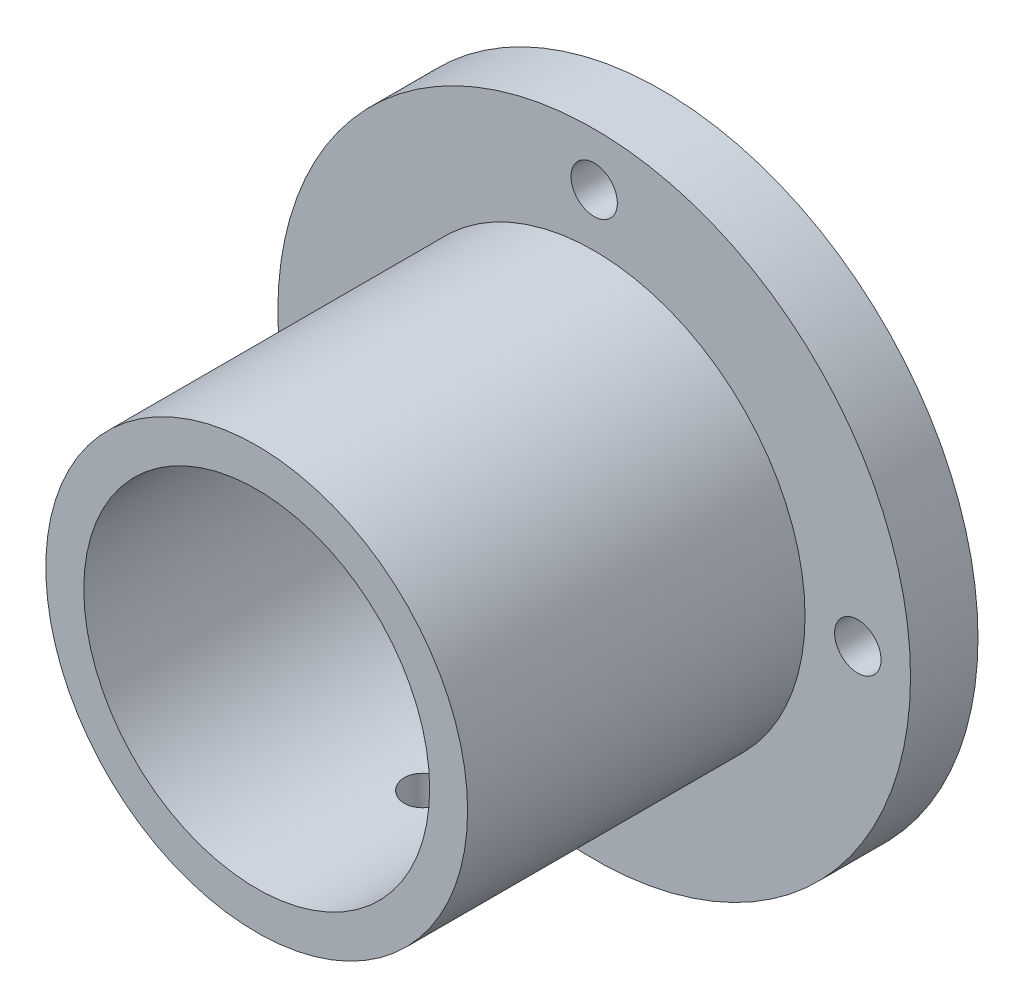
ISO-10303-21;
HEADER;
FILE_DESCRIPTION(('STEP AP214'),'2;1');
FILE_NAME('part.step','',(''),(''),'','','');
FILE_SCHEMA(('AUTOMOTIVE_DESIGN { 1 0 10303 214 1 1 1 1 }'));
ENDSEC;
DATA;
#1=APPLICATION_CONTEXT('core data for automotive mechanical design processes');
#2=APPLICATION_PROTOCOL_DEFINITION('international standard','automotive_design',2000,#1);
#3=PRODUCT_CONTEXT('',#1,'mechanical');
#4=PRODUCT('Part','Part','',(#3));
#5=PRODUCT_RELATED_PRODUCT_CATEGORY('part','',(#4));
#6=PRODUCT_DEFINITION_FORMATION('','',#4);
#7=PRODUCT_DEFINITION_CONTEXT('part definition',#1,'design');
#8=PRODUCT_DEFINITION('design','',#6,#7);
#9=PRODUCT_DEFINITION_SHAPE('','',#8);
#10=(LENGTH_UNIT() NAMED_UNIT(*) SI_UNIT(.MILLI.,.METRE.));
#11=(NAMED_UNIT(*) PLANE_ANGLE_UNIT() SI_UNIT($,.RADIAN.));
#12=(NAMED_UNIT(*) SI_UNIT($,.STERADIAN.) SOLID_ANGLE_UNIT());
#13=UNCERTAINTY_MEASURE_WITH_UNIT(LENGTH_MEASURE(1.E-05),#10,'distance_accuracy_value','');
#14=(GEOMETRIC_REPRESENTATION_CONTEXT(3) GLOBAL_UNCERTAINTY_ASSIGNED_CONTEXT((#13)) GLOBAL_UNIT_ASSIGNED_CONTEXT((#10,
#11,#12)) REPRESENTATION_CONTEXT('',''));
#15=CARTESIAN_POINT('',(0.,0.,0.));
#16=DIRECTION('',(0.,0.,1.));
#17=DIRECTION('',(1.,0.,0.));
#18=AXIS2_PLACEMENT_3D('',#15,#16,#17);
#19=CARTESIAN_POINT('',(0.,0.,8.));
#20=DIRECTION('',(0.,0.,1.));
#21=DIRECTION('',(1.,0.,0.));
#22=AXIS2_PLACEMENT_3D('',#19,#20,#21);
#23=PLANE('',#22);
#24=CARTESIAN_POINT('',(-31.25,0.,8.));
#25=DIRECTION('',(0.,0.,1.));
#26=DIRECTION('',(1.,0.,0.));
#27=AXIS2_PLACEMENT_3D('',#24,#25,#26);
#28=CIRCLE('',#27,2.75);
#29=CARTESIAN_POINT('',(-28.5,0.,8.));
#30=VERTEX_POINT('',#29);
#31=EDGE_CURVE('E64',#30,#30,#28,.T.);
#32=ORIENTED_EDGE('',*,*,#31,.F.);
#33=EDGE_LOOP('',(#32));
#34=FACE_BOUND('',#33,.T.);
#35=CARTESIAN_POINT('',(31.25,0.,8.));
#36=DIRECTION('',(0.,0.,1.));
#37=DIRECTION('',(1.,0.,0.));
#38=AXIS2_PLACEMENT_3D('',#35,#36,#37);
#39=CIRCLE('',#38,2.75);
#40=CARTESIAN_POINT('',(34.,0.,8.));
#41=VERTEX_POINT('',#40);
#42=EDGE_CURVE('E52',#41,#41,#39,.T.);
#43=ORIENTED_EDGE('',*,*,#42,.F.);
#44=EDGE_LOOP('',(#43));
#45=FACE_BOUND('',#44,.T.);
#46=CARTESIAN_POINT('',(0.,0.,8.));
#47=DIRECTION('',(0.,0.,1.));
#48=DIRECTION('',(1.,0.,0.));
#49=AXIS2_PLACEMENT_3D('',#46,#47,#48);
#50=CIRCLE('',#49,37.5);
#51=CARTESIAN_POINT('',(37.5,0.,8.));
#52=VERTEX_POINT('',#51);
#53=EDGE_CURVE('E10',#52,#52,#50,.T.);
#54=ORIENTED_EDGE('',*,*,#53,.T.);
#55=EDGE_LOOP('',(#54));
#56=FACE_BOUND('',#55,.T.);
#57=CARTESIAN_POINT('',(0.,-31.25,8.));
#58=DIRECTION('',(0.,0.,1.));
#59=DIRECTION('',(1.,0.,0.));
#60=AXIS2_PLACEMENT_3D('',#57,#58,#59);
#61=CIRCLE('',#60,2.75);
#62=CARTESIAN_POINT('',(2.75,-31.25,8.));
#63=VERTEX_POINT('',#62);
#64=EDGE_CURVE('E47',#63,#63,#61,.T.);
#65=ORIENTED_EDGE('',*,*,#64,.F.);
#66=EDGE_LOOP('',(#65));
#67=FACE_BOUND('',#66,.T.);
#68=CARTESIAN_POINT('',(0.,31.25,8.));
#69=DIRECTION('',(0.,0.,1.));
#70=DIRECTION('',(1.,0.,0.));
#71=AXIS2_PLACEMENT_3D('',#68,#69,#70);
#72=CIRCLE('',#71,2.75);
#73=CARTESIAN_POINT('',(2.75,31.25,8.));
#74=VERTEX_POINT('',#73);
#75=EDGE_CURVE('E58',#74,#74,#72,.T.);
#76=ORIENTED_EDGE('',*,*,#75,.F.);
#77=EDGE_LOOP('',(#76));
#78=FACE_BOUND('',#77,.T.);
#79=CARTESIAN_POINT('',(0.,0.,8.));
#80=DIRECTION('',(0.,0.,1.));
#81=DIRECTION('',(1.,0.,0.));
#82=AXIS2_PLACEMENT_3D('',#79,#80,#81);
#83=CIRCLE('',#82,25.);
#84=CARTESIAN_POINT('',(25.,0.,8.));
#85=VERTEX_POINT('',#84);
#86=EDGE_CURVE('E73',#85,#85,#83,.T.);
#87=ORIENTED_EDGE('',*,*,#86,.F.);
#88=EDGE_LOOP('',(#87));
#89=FACE_BOUND('',#88,.T.);
#90=ADVANCED_FACE('F30',(#34,#45,#56,#67,#78,#89),#23,.T.);
#91=CARTESIAN_POINT('',(0.,0.,0.));
#92=DIRECTION('',(0.,0.,1.));
#93=DIRECTION('',(1.,0.,0.));
#94=AXIS2_PLACEMENT_3D('',#91,#92,#93);
#95=PLANE('',#94);
#96=CARTESIAN_POINT('',(0.,0.,0.));
#97=DIRECTION('',(0.,0.,1.));
#98=DIRECTION('',(1.,0.,0.));
#99=AXIS2_PLACEMENT_3D('',#96,#97,#98);
#100=CIRCLE('',#99,20.5);
#101=CARTESIAN_POINT('',(20.5,0.,0.));
#102=VERTEX_POINT('',#101);
#103=EDGE_CURVE('E76',#102,#102,#100,.T.);
#104=ORIENTED_EDGE('',*,*,#103,.T.);
#105=EDGE_LOOP('',(#104));
#106=FACE_BOUND('',#105,.T.);
#107=CARTESIAN_POINT('',(0.,31.25,0.));
#108=DIRECTION('',(0.,0.,1.));
#109=DIRECTION('',(1.,0.,0.));
#110=AXIS2_PLACEMENT_3D('',#107,#108,#109);
#111=CIRCLE('',#110,2.75);
#112=CARTESIAN_POINT('',(2.75,31.25,0.));
#113=VERTEX_POINT('',#112);
#114=EDGE_CURVE('E61',#113,#113,#111,.T.);
#115=ORIENTED_EDGE('',*,*,#114,.T.);
#116=EDGE_LOOP('',(#115));
#117=FACE_BOUND('',#116,.T.);
#118=CARTESIAN_POINT('',(0.,-31.25,0.));
#119=DIRECTION('',(0.,0.,1.));
#120=DIRECTION('',(1.,0.,0.));
#121=AXIS2_PLACEMENT_3D('',#118,#119,#120);
#122=CIRCLE('',#121,2.75);
#123=CARTESIAN_POINT('',(2.75,-31.25,0.));
#124=VERTEX_POINT('',#123);
#125=EDGE_CURVE('E49',#124,#124,#122,.T.);
#126=ORIENTED_EDGE('',*,*,#125,.T.);
#127=EDGE_LOOP('',(#126));
#128=FACE_BOUND('',#127,.T.);
#129=CARTESIAN_POINT('',(0.,0.,0.));
#130=DIRECTION('',(0.,0.,1.));
#131=DIRECTION('',(1.,0.,0.));
#132=AXIS2_PLACEMENT_3D('',#129,#130,#131);
#133=CIRCLE('',#132,37.5);
#134=CARTESIAN_POINT('',(37.5,0.,0.));
#135=VERTEX_POINT('',#134);
#136=EDGE_CURVE('E42',#135,#135,#133,.T.);
#137=ORIENTED_EDGE('',*,*,#136,.F.);
#138=EDGE_LOOP('',(#137));
#139=FACE_BOUND('',#138,.T.);
#140=CARTESIAN_POINT('',(31.25,0.,0.));
#141=DIRECTION('',(0.,0.,1.));
#142=DIRECTION('',(1.,0.,0.));
#143=AXIS2_PLACEMENT_3D('',#140,#141,#142);
#144=CIRCLE('',#143,2.75);
#145=CARTESIAN_POINT('',(34.,0.,0.));
#146=VERTEX_POINT('',#145);
#147=EDGE_CURVE('E55',#146,#146,#144,.T.);
#148=ORIENTED_EDGE('',*,*,#147,.T.);
#149=EDGE_LOOP('',(#148));
#150=FACE_BOUND('',#149,.T.);
#151=CARTESIAN_POINT('',(-31.25,0.,0.));
#152=DIRECTION('',(0.,0.,1.));
#153=DIRECTION('',(1.,0.,0.));
#154=AXIS2_PLACEMENT_3D('',#151,#152,#153);
#155=CIRCLE('',#154,2.75);
#156=CARTESIAN_POINT('',(-28.5,0.,0.));
#157=VERTEX_POINT('',#156);
#158=EDGE_CURVE('E67',#157,#157,#155,.T.);
#159=ORIENTED_EDGE('',*,*,#158,.T.);
#160=EDGE_LOOP('',(#159));
#161=FACE_BOUND('',#160,.T.);
#162=ADVANCED_FACE('F113',(#106,#117,#128,#139,#150,#161),#95,.F.);
#163=CARTESIAN_POINT('',(0.,0.,8.));
#164=DIRECTION('',(0.,0.,-1.));
#165=DIRECTION('',(-1.,0.,0.));
#166=AXIS2_PLACEMENT_3D('',#163,#164,#165);
#167=CYLINDRICAL_SURFACE('',#166,37.5);
#168=ORIENTED_EDGE('',*,*,#53,.F.);
#169=EDGE_LOOP('',(#168));
#170=FACE_BOUND('',#169,.T.);
#171=ORIENTED_EDGE('',*,*,#136,.T.);
#172=EDGE_LOOP('',(#171));
#173=FACE_BOUND('',#172,.T.);
#174=ADVANCED_FACE('F32',(#170,#173),#167,.T.);
#175=CARTESIAN_POINT('',(0.,-31.25,8.));
#176=DIRECTION('',(0.,0.,-1.));
#177=DIRECTION('',(-1.,0.,0.));
#178=AXIS2_PLACEMENT_3D('',#175,#176,#177);
#179=CYLINDRICAL_SURFACE('',#178,2.75);
#180=ORIENTED_EDGE('',*,*,#64,.T.);
#181=EDGE_LOOP('',(#180));
#182=FACE_BOUND('',#181,.T.);
#183=ORIENTED_EDGE('',*,*,#125,.F.);
#184=EDGE_LOOP('',(#183));
#185=FACE_BOUND('',#184,.T.);
#186=ADVANCED_FACE('F123',(#182,#185),#179,.F.);
#187=CARTESIAN_POINT('',(31.25,0.,8.));
#188=DIRECTION('',(0.,0.,-1.));
#189=DIRECTION('',(-1.,0.,0.));
#190=AXIS2_PLACEMENT_3D('',#187,#188,#189);
#191=CYLINDRICAL_SURFACE('',#190,2.75);
#192=ORIENTED_EDGE('',*,*,#42,.T.);
#193=EDGE_LOOP('',(#192));
#194=FACE_BOUND('',#193,.T.);
#195=ORIENTED_EDGE('',*,*,#147,.F.);
#196=EDGE_LOOP('',(#195));
#197=FACE_BOUND('',#196,.T.);
#198=ADVANCED_FACE('F126',(#194,#197),#191,.F.);
#199=CARTESIAN_POINT('',(0.,31.25,8.));
#200=DIRECTION('',(0.,0.,-1.));
#201=DIRECTION('',(-1.,0.,0.));
#202=AXIS2_PLACEMENT_3D('',#199,#200,#201);
#203=CYLINDRICAL_SURFACE('',#202,2.75);
#204=ORIENTED_EDGE('',*,*,#75,.T.);
#205=EDGE_LOOP('',(#204));
#206=FACE_BOUND('',#205,.T.);
#207=ORIENTED_EDGE('',*,*,#114,.F.);
#208=EDGE_LOOP('',(#207));
#209=FACE_BOUND('',#208,.T.);
#210=ADVANCED_FACE('F130',(#206,#209),#203,.F.);
#211=CARTESIAN_POINT('',(-31.25,0.,8.));
#212=DIRECTION('',(0.,0.,-1.));
#213=DIRECTION('',(-1.,0.,0.));
#214=AXIS2_PLACEMENT_3D('',#211,#212,#213);
#215=CYLINDRICAL_SURFACE('',#214,2.75);
#216=ORIENTED_EDGE('',*,*,#31,.T.);
#217=EDGE_LOOP('',(#216));
#218=FACE_BOUND('',#217,.T.);
#219=ORIENTED_EDGE('',*,*,#158,.F.);
#220=EDGE_LOOP('',(#219));
#221=FACE_BOUND('',#220,.T.);
#222=ADVANCED_FACE('F108',(#218,#221),#215,.F.);
#223=CARTESIAN_POINT('',(0.,0.,48.));
#224=DIRECTION('',(0.,0.,-1.));
#225=DIRECTION('',(-1.,0.,0.));
#226=AXIS2_PLACEMENT_3D('',#223,#224,#225);
#227=CYLINDRICAL_SURFACE('',#226,25.);
#228=CARTESIAN_POINT('',(0.,-25.,30.5));
#229=CARTESIAN_POINT('',(0.140050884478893,-24.9999983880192,30.4999939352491));
#230=CARTESIAN_POINT('',(0.280194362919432,-24.9988106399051,30.4881918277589));
#231=CARTESIAN_POINT('',(0.556595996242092,-24.9941866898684,30.4412890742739));
#232=CARTESIAN_POINT('',(0.69284969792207,-24.9907480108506,30.4061627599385));
#233=CARTESIAN_POINT('',(0.957429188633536,-24.9820103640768,30.3136443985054));
#234=CARTESIAN_POINT('',(1.08575971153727,-24.9767125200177,30.2562657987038));
#235=CARTESIAN_POINT('',(1.33094040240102,-24.9648489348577,30.1208977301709));
#236=CARTESIAN_POINT('',(1.44779284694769,-24.9582834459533,30.0429123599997));
#237=CARTESIAN_POINT('',(1.6671488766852,-24.9445936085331,29.8682432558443));
#238=CARTESIAN_POINT('',(1.76960536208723,-24.9374675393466,29.7715005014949));
#239=CARTESIAN_POINT('',(1.95685630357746,-24.9234739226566,29.5621886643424));
#240=CARTESIAN_POINT('',(2.04164994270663,-24.9166063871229,29.449618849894));
#241=CARTESIAN_POINT('',(2.19133492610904,-24.9038897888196,29.2115536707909));
#242=CARTESIAN_POINT('',(2.2561836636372,-24.8980429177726,29.0860313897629));
#243=CARTESIAN_POINT('',(2.3638659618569,-24.8880509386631,28.8258110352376));
#244=CARTESIAN_POINT('',(2.40670006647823,-24.8839057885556,28.6911131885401));
#245=CARTESIAN_POINT('',(2.46899760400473,-24.8778021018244,28.416845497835));
#246=CARTESIAN_POINT('',(2.48853913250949,-24.8758362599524,28.2772935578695));
#247=CARTESIAN_POINT('',(2.5039382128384,-24.8742910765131,27.9968778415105));
#248=CARTESIAN_POINT('',(2.499796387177,-24.8747116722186,27.8560140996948));
#249=CARTESIAN_POINT('',(2.4680107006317,-24.8778851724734,27.5775117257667));
#250=CARTESIAN_POINT('',(2.44045211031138,-24.8806296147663,27.4398632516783));
#251=CARTESIAN_POINT('',(2.36274786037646,-24.8881283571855,27.1711550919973));
#252=CARTESIAN_POINT('',(2.31260189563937,-24.8928826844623,27.0400954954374));
#253=CARTESIAN_POINT('',(2.19105223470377,-24.9038752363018,26.7880160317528));
#254=CARTESIAN_POINT('',(2.11961070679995,-24.9101160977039,26.6670145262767));
#255=CARTESIAN_POINT('',(1.95752506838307,-24.923376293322,26.4386869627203));
#256=CARTESIAN_POINT('',(1.86688039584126,-24.9303956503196,26.3313613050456));
#257=CARTESIAN_POINT('',(1.66848528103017,-24.9444596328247,26.1329365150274));
#258=CARTESIAN_POINT('',(1.56066119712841,-24.9515042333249,26.041910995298));
#259=CARTESIAN_POINT('',(1.33122370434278,-24.964795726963,25.879240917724));
#260=CARTESIAN_POINT('',(1.209610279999,-24.9710426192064,25.8075963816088));
#261=CARTESIAN_POINT('',(0.955995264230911,-24.9820368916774,25.6857249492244));
#262=CARTESIAN_POINT('',(0.823991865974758,-24.9867840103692,25.6355017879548));
#263=CARTESIAN_POINT('',(0.553368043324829,-24.9942411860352,25.5579527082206));
#264=CARTESIAN_POINT('',(0.4147478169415,-24.9969513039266,25.5306261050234));
#265=CARTESIAN_POINT('',(0.135462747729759,-25.0000212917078,25.4997392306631));
#266=CARTESIAN_POINT('',(-0.00519075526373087,-25.0003912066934,25.4960773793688));
#267=CARTESIAN_POINT('',(-0.28510948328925,-24.9987660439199,25.5123571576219));
#268=CARTESIAN_POINT('',(-0.424374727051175,-24.9967709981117,25.5322984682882));
#269=CARTESIAN_POINT('',(-0.697270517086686,-24.9906465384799,25.5951342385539));
#270=CARTESIAN_POINT('',(-0.830912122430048,-24.986521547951,25.637981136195));
#271=CARTESIAN_POINT('',(-1.08911080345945,-24.9765999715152,25.7453629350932));
#272=CARTESIAN_POINT('',(-1.21366767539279,-24.9708033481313,25.8098983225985));
#273=CARTESIAN_POINT('',(-1.45062045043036,-24.9581618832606,25.9590770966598));
#274=CARTESIAN_POINT('',(-1.56297414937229,-24.951313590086,26.0437872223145));
#275=CARTESIAN_POINT('',(-1.7719040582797,-24.937348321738,26.2308151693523));
#276=CARTESIAN_POINT('',(-1.86847987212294,-24.9302313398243,26.3331334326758));
#277=CARTESIAN_POINT('',(-2.04346527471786,-24.9165006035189,26.5529164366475));
#278=CARTESIAN_POINT('',(-2.12180819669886,-24.9098887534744,26.6704343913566));
#279=CARTESIAN_POINT('',(-2.25764564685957,-24.8979458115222,26.9170184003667));
#280=CARTESIAN_POINT('',(-2.3151404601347,-24.8926147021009,27.046084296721));
#281=CARTESIAN_POINT('',(-2.40753802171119,-24.8838486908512,27.3118718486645));
#282=CARTESIAN_POINT('',(-2.44248043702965,-24.8804104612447,27.4485796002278));
#283=CARTESIAN_POINT('',(-2.48891001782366,-24.8758091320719,27.7259579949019));
#284=CARTESIAN_POINT('',(-2.50039785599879,-24.8746459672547,27.8666285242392));
#285=CARTESIAN_POINT('',(-2.49958284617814,-24.8747278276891,28.1472767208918));
#286=CARTESIAN_POINT('',(-2.48738472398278,-24.8759622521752,28.287254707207));
#287=CARTESIAN_POINT('',(-2.43976363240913,-24.8806775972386,28.5631622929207));
#288=CARTESIAN_POINT('',(-2.4043406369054,-24.884158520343,28.699091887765));
#289=CARTESIAN_POINT('',(-2.31130421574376,-24.8929717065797,28.9630433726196));
#290=CARTESIAN_POINT('',(-2.25369386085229,-24.898303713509,29.0910663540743));
#291=CARTESIAN_POINT('',(-2.11792888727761,-24.910218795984,29.3356422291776));
#292=CARTESIAN_POINT('',(-2.03977438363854,-24.9168018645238,29.4521951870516));
#293=CARTESIAN_POINT('',(-1.86474639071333,-24.9305121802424,29.6710591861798));
#294=CARTESIAN_POINT('',(-1.76779487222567,-24.9376416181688,29.7733076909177));
#295=CARTESIAN_POINT('',(-1.55807924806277,-24.9516213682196,29.9601305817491));
#296=CARTESIAN_POINT('',(-1.44531136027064,-24.9584716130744,30.0447007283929));
#297=CARTESIAN_POINT('',(-1.20685358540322,-24.971139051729,30.1939336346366));
#298=CARTESIAN_POINT('',(-1.08113187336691,-24.9769536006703,30.258545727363));
#299=CARTESIAN_POINT('',(-0.820645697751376,-24.9868657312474,30.3656560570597));
#300=CARTESIAN_POINT('',(-0.685891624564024,-24.9909652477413,30.4081792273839));
#301=CARTESIAN_POINT('',(-0.458645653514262,-24.9959553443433,30.459301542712));
#302=CARTESIAN_POINT('',(-0.367606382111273,-24.9974650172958,30.4745426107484));
#303=CARTESIAN_POINT('',(-0.184391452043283,-24.9994878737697,30.4948938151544));
#304=CARTESIAN_POINT('',(-0.0922157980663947,-25.0000010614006,30.5000039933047));
#305=CARTESIAN_POINT('',(0.,-25.,30.5));
#306=B_SPLINE_CURVE_WITH_KNOTS('',3,(#228,#229,#230,#231,#232,#233,#234,#235,#236,#237,#238,
#239,#240,#241,#242,#243,#244,#245,#246,#247,#248,#249,#250,#251,#252,#253,#254,#255,#256,#257,
#258,#259,#260,#261,#262,#263,#264,#265,#266,#267,#268,#269,#270,#271,#272,#273,#274,#275,#276,
#277,#278,#279,#280,#281,#282,#283,#284,#285,#286,#287,#288,#289,#290,#291,#292,#293,#294,#295,
#296,#297,#298,#299,#300,#301,#302,#303,#304,#305),.UNSPECIFIED.,.T.,.F.,(4,2,2,2,2,2,2,2,2,2,2,
2,2,2,2,2,2,2,2,2,2,2,2,2,2,2,2,2,2,2,2,2,2,2,2,2,2,2,4),(0.,0.419815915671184,
0.840094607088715,1.26011971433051,1.68006134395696,2.10134642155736,2.52265098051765,
2.94484938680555,3.3670373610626,3.78780580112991,4.20856318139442,4.62779493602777,
5.04703235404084,5.46701903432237,5.88701800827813,6.30886835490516,6.73071917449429,
7.15264351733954,7.57455524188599,7.99465471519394,8.41474851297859,8.83397338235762,
9.25320765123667,9.67384851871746,10.0944999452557,10.516666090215,10.9388264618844,
11.3602422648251,11.7816459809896,12.2011907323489,12.620735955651,13.04022313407,
13.459707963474,13.8809729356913,14.3023388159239,14.7247657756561,15.1467148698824,
15.4231416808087,15.6995673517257),.UNSPECIFIED.);
#307=CARTESIAN_POINT('',(0.,-25.,30.5));
#308=VERTEX_POINT('',#307);
#309=EDGE_CURVE('E82',#308,#308,#306,.T.);
#310=ORIENTED_EDGE('',*,*,#309,.T.);
#311=EDGE_LOOP('',(#310));
#312=FACE_BOUND('',#311,.T.);
#313=CARTESIAN_POINT('',(0.,0.,48.));
#314=DIRECTION('',(0.,0.,1.));
#315=DIRECTION('',(1.,0.,0.));
#316=AXIS2_PLACEMENT_3D('',#313,#314,#315);
#317=CIRCLE('',#316,25.);
#318=CARTESIAN_POINT('',(25.,0.,48.));
#319=VERTEX_POINT('',#318);
#320=EDGE_CURVE('E70',#319,#319,#317,.T.);
#321=ORIENTED_EDGE('',*,*,#320,.F.);
#322=EDGE_LOOP('',(#321));
#323=FACE_BOUND('',#322,.T.);
#324=ORIENTED_EDGE('',*,*,#86,.T.);
#325=EDGE_LOOP('',(#324));
#326=FACE_BOUND('',#325,.T.);
#327=ADVANCED_FACE('F89',(#312,#323,#326),#227,.T.);
#328=CARTESIAN_POINT('',(0.,0.,48.));
#329=DIRECTION('',(0.,0.,1.));
#330=DIRECTION('',(1.,0.,0.));
#331=AXIS2_PLACEMENT_3D('',#328,#329,#330);
#332=PLANE('',#331);
#333=CARTESIAN_POINT('',(0.,0.,48.));
#334=DIRECTION('',(0.,0.,1.));
#335=DIRECTION('',(1.,0.,0.));
#336=AXIS2_PLACEMENT_3D('',#333,#334,#335);
#337=CIRCLE('',#336,20.5);
#338=CARTESIAN_POINT('',(20.5,0.,48.));
#339=VERTEX_POINT('',#338);
#340=EDGE_CURVE('E79',#339,#339,#337,.T.);
#341=ORIENTED_EDGE('',*,*,#340,.F.);
#342=EDGE_LOOP('',(#341));
#343=FACE_BOUND('',#342,.T.);
#344=ORIENTED_EDGE('',*,*,#320,.T.);
#345=EDGE_LOOP('',(#344));
#346=FACE_BOUND('',#345,.T.);
#347=ADVANCED_FACE('F101',(#343,#346),#332,.T.);
#348=CARTESIAN_POINT('',(0.,0.,0.));
#349=DIRECTION('',(0.,0.,1.));
#350=DIRECTION('',(1.,0.,0.));
#351=AXIS2_PLACEMENT_3D('',#348,#349,#350);
#352=CYLINDRICAL_SURFACE('',#351,20.5);
#353=CARTESIAN_POINT('',(0.,-20.5,30.5));
#354=CARTESIAN_POINT('',(-0.139869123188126,-20.4999980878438,30.4999940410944));
#355=CARTESIAN_POINT('',(-0.279826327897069,-20.4985534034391,30.4882224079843));
#356=CARTESIAN_POINT('',(-0.55584812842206,-20.4929292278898,30.4414477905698));
#357=CARTESIAN_POINT('',(-0.691908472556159,-20.4887468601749,30.4064203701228));
#358=CARTESIAN_POINT('',(-0.956100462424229,-20.4781186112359,30.3141798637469));
#359=CARTESIAN_POINT('',(-1.08423730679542,-20.4716742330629,30.2569815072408));
#360=CARTESIAN_POINT('',(-1.32906818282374,-20.4572392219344,30.1220545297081));
#361=CARTESIAN_POINT('',(-1.44576421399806,-20.4492488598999,30.0443295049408));
#362=CARTESIAN_POINT('',(-1.66503849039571,-20.4325674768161,29.8701189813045));
#363=CARTESIAN_POINT('',(-1.76754802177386,-20.4238733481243,29.7735472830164));
#364=CARTESIAN_POINT('',(-1.95494779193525,-20.4067894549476,29.5645696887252));
#365=CARTESIAN_POINT('',(-2.03983714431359,-20.3983997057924,29.4521629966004));
#366=CARTESIAN_POINT('',(-2.18984130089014,-20.3828437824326,29.2142616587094));
#367=CARTESIAN_POINT('',(-2.25489199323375,-20.3756816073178,29.0887263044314));
#368=CARTESIAN_POINT('',(-2.36296285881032,-20.3634324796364,28.8284112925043));
#369=CARTESIAN_POINT('',(-2.40598382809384,-20.3583454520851,28.6936319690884));
#370=CARTESIAN_POINT('',(-2.46856584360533,-20.3508521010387,28.419366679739));
#371=CARTESIAN_POINT('',(-2.48824268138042,-20.3484325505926,28.2799075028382));
#372=CARTESIAN_POINT('',(-2.50393613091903,-20.3465075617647,27.9996469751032));
#373=CARTESIAN_POINT('',(-2.49995364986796,-20.3470020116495,27.8588456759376));
#374=CARTESIAN_POINT('',(-2.46853661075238,-20.3508370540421,27.58070352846));
#375=CARTESIAN_POINT('',(-2.44122945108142,-20.3541621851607,27.4433480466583));
#376=CARTESIAN_POINT('',(-2.36413690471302,-20.3632598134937,27.1751838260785));
#377=CARTESIAN_POINT('',(-2.31435108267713,-20.3690323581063,27.0443752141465));
#378=CARTESIAN_POINT('',(-2.19357702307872,-20.3823919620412,26.7926212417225));
#379=CARTESIAN_POINT('',(-2.12253326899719,-20.3899837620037,26.6717027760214));
#380=CARTESIAN_POINT('',(-1.96129975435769,-20.4061227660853,26.443456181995));
#381=CARTESIAN_POINT('',(-1.87110916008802,-20.4146700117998,26.3361286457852));
#382=CARTESIAN_POINT('',(-1.67343536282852,-20.4318256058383,26.1373709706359));
#383=CARTESIAN_POINT('',(-1.56584232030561,-20.4404339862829,26.0460500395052));
#384=CARTESIAN_POINT('',(-1.33679641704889,-20.4566892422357,25.8827476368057));
#385=CARTESIAN_POINT('',(-1.21534352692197,-20.4643361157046,25.8107662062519));
#386=CARTESIAN_POINT('',(-0.961942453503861,-20.4778111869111,25.6881866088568));
#387=CARTESIAN_POINT('',(-0.829991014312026,-20.4836388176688,25.6375951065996));
#388=CARTESIAN_POINT('',(-0.559379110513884,-20.4928135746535,25.5593172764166));
#389=CARTESIAN_POINT('',(-0.420718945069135,-20.49616081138,25.5316299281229));
#390=CARTESIAN_POINT('',(-0.141570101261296,-20.499983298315,25.5000874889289));
#391=CARTESIAN_POINT('',(-0.00109866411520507,-20.5004766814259,25.4960819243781));
#392=CARTESIAN_POINT('',(0.278513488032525,-20.4985847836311,25.5116199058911));
#393=CARTESIAN_POINT('',(0.417654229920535,-20.4961995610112,25.531162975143));
#394=CARTESIAN_POINT('',(0.690212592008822,-20.4888297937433,25.5931184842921));
#395=CARTESIAN_POINT('',(0.823646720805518,-20.4838533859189,25.6354593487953));
#396=CARTESIAN_POINT('',(1.08152018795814,-20.4718585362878,25.7417342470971));
#397=CARTESIAN_POINT('',(1.20595923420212,-20.4648400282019,25.8056689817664));
#398=CARTESIAN_POINT('',(1.44298330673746,-20.4494985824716,25.9536820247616));
#399=CARTESIAN_POINT('',(1.55550701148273,-20.4411693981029,26.037857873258));
#400=CARTESIAN_POINT('',(1.76488280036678,-20.4241583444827,26.2238254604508));
#401=CARTESIAN_POINT('',(1.86173429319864,-20.4154764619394,26.3256178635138));
#402=CARTESIAN_POINT('',(2.03754876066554,-20.3986827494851,26.5445910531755));
#403=CARTESIAN_POINT('',(2.11641211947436,-20.3905742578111,26.6618521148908));
#404=CARTESIAN_POINT('',(2.25332394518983,-20.3758997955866,26.9080436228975));
#405=CARTESIAN_POINT('',(2.31137281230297,-20.3693337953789,27.0369738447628));
#406=CARTESIAN_POINT('',(2.40484584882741,-20.3585102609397,27.3025197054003));
#407=CARTESIAN_POINT('',(2.44032659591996,-20.3542469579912,27.4391151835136));
#408=CARTESIAN_POINT('',(2.48783861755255,-20.3484948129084,27.7163804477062));
#409=CARTESIAN_POINT('',(2.49987092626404,-20.3470058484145,27.857050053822));
#410=CARTESIAN_POINT('',(2.50012616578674,-20.3469744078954,28.1374795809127));
#411=CARTESIAN_POINT('',(2.48850559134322,-20.3484125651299,28.2772393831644));
#412=CARTESIAN_POINT('',(2.44211588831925,-20.3540317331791,28.5528038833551));
#413=CARTESIAN_POINT('',(2.40734675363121,-20.3582127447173,28.6886085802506));
#414=CARTESIAN_POINT('',(2.31569508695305,-20.3688406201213,28.9523898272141));
#415=CARTESIAN_POINT('',(2.25881970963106,-20.3752867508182,29.0803688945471));
#416=CARTESIAN_POINT('',(2.1245854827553,-20.3897197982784,29.3249915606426));
#417=CARTESIAN_POINT('',(2.04722642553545,-20.3977067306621,29.4416350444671));
#418=CARTESIAN_POINT('',(1.87363904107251,-20.4143847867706,29.6610758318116));
#419=CARTESIAN_POINT('',(1.77729404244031,-20.4230800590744,29.7637805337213));
#420=CARTESIAN_POINT('',(1.56871201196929,-20.4401582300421,29.9516257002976));
#421=CARTESIAN_POINT('',(1.45647123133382,-20.4485410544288,30.0367620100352));
#422=CARTESIAN_POINT('',(1.21881917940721,-20.464083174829,30.1873144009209));
#423=CARTESIAN_POINT('',(1.09336163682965,-20.4712379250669,30.2526578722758));
#424=CARTESIAN_POINT('',(0.833238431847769,-20.483471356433,30.3612571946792));
#425=CARTESIAN_POINT('',(0.698583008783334,-20.4885523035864,30.404537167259));
#426=CARTESIAN_POINT('',(0.469351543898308,-20.4948338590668,30.4573630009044));
#427=CARTESIAN_POINT('',(0.376223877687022,-20.4967617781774,30.4733290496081));
#428=CARTESIAN_POINT('',(0.188744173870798,-20.4993454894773,30.4946495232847));
#429=CARTESIAN_POINT('',(0.0943921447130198,-20.5000012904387,30.5000040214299));
#430=CARTESIAN_POINT('',(0.,-20.5,30.5));
#431=B_SPLINE_CURVE_WITH_KNOTS('',3,(#353,#354,#355,#356,#357,#358,#359,#360,#361,#362,#363,
#364,#365,#366,#367,#368,#369,#370,#371,#372,#373,#374,#375,#376,#377,#378,#379,#380,#381,#382,
#383,#384,#385,#386,#387,#388,#389,#390,#391,#392,#393,#394,#395,#396,#397,#398,#399,#400,#401,
#402,#403,#404,#405,#406,#407,#408,#409,#410,#411,#412,#413,#414,#415,#416,#417,#418,#419,#420,
#421,#422,#423,#424,#425,#426,#427,#428,#429,#430),.UNSPECIFIED.,.T.,.F.,(4,2,2,2,2,2,2,2,2,2,2,
2,2,2,2,2,2,2,2,2,2,2,2,2,2,2,2,2,2,2,2,2,2,2,2,2,2,2,4),(0.,0.419262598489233,
0.838966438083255,1.25839192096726,1.67774396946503,2.09906097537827,2.52039917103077,
2.94308490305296,3.36575536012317,3.78632040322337,4.2068693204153,4.62513579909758,
5.043410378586,5.46278698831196,5.88218186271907,6.30433529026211,6.72648961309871,
7.14877537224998,7.57104231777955,7.99062327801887,8.41019574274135,8.82845854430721,
9.24673492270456,9.66706882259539,10.0874185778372,10.5100425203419,10.9326583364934,
11.3542104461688,11.7757439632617,12.1944975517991,12.6132512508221,13.0318695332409,
13.4504920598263,13.8717721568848,14.2931517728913,14.7160589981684,15.1385028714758,
15.4214485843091,15.7043923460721),.UNSPECIFIED.);
#432=CARTESIAN_POINT('',(0.,-20.5,30.5));
#433=VERTEX_POINT('',#432);
#434=EDGE_CURVE('E34',#433,#433,#431,.T.);
#435=ORIENTED_EDGE('',*,*,#434,.T.);
#436=EDGE_LOOP('',(#435));
#437=FACE_BOUND('',#436,.T.);
#438=ORIENTED_EDGE('',*,*,#103,.F.);
#439=EDGE_LOOP('',(#438));
#440=FACE_BOUND('',#439,.T.);
#441=ORIENTED_EDGE('',*,*,#340,.T.);
#442=EDGE_LOOP('',(#441));
#443=FACE_BOUND('',#442,.T.);
#444=ADVANCED_FACE('F96',(#437,#440,#443),#352,.F.);
#445=CARTESIAN_POINT('',(0.,-30.,28.));
#446=DIRECTION('',(0.,1.,0.));
#447=DIRECTION('',(0.,0.,1.));
#448=AXIS2_PLACEMENT_3D('',#445,#446,#447);
#449=CYLINDRICAL_SURFACE('',#448,2.5);
#450=ORIENTED_EDGE('',*,*,#434,.F.);
#451=EDGE_LOOP('',(#450));
#452=FACE_BOUND('',#451,.T.);
#453=ORIENTED_EDGE('',*,*,#309,.F.);
#454=EDGE_LOOP('',(#453));
#455=FACE_BOUND('',#454,.T.);
#456=ADVANCED_FACE('F93',(#452,#455),#449,.F.);
#457=CLOSED_SHELL('',(#90,#162,#174,#186,#198,#210,#222,#327,#347,#444,#456));
#458=MANIFOLD_SOLID_BREP('B2',#457);
#459=ADVANCED_BREP_SHAPE_REPRESENTATION('',(#18,#458),#14);
#460=SHAPE_DEFINITION_REPRESENTATION(#9,#459);
ENDSEC;
END-ISO-10303-21;
